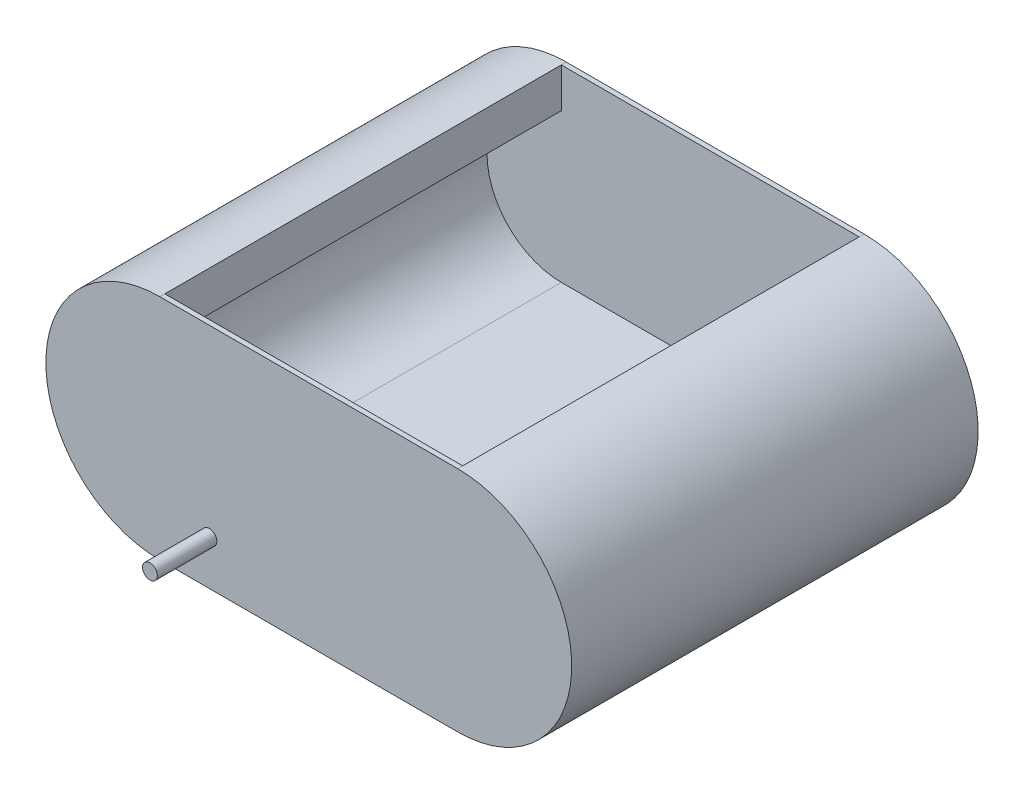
from build123d import *

# Parameters (mm, degrees)
SALIENTE_EXTRUIR2_DEPTH = 800
CROQUIS3_W              = 600.904889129
CROQUIS3_H              = 80
SALIENTE_EXTRUIR3_DEPTH = 10
SALIENTE_EXTRUIR4_START = 10
CROQUIS4_W              = 600.904889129
CROQUIS4_H              = 80
SALIENTE_EXTRUIR4_DEPTH = 10
CROQUIS5_R              = 15
SALIENTE_EXTRUIR5_DEPTH = 120
SALIENTE_EXTRUIR6_START = 120
CROQUIS6_R              = 15
SALIENTE_EXTRUIR6_DEPTH = 120


with BuildPart() as part:
    # Croquis2 → Saliente-Extruir2 (new body)
    with BuildSketch(Plane.XY):
        with BuildLine():
            Line((0, -230), (600.904889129, -230))
            ThreePointArc((600.904889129, -230), (830.904889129, 0), (600.904889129, 230))
            Line((600.904889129, 230), (600.904889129, 150))
            ThreePointArc((600.904889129, 150), (750.904889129, 0), (600.904889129, -150))
            Line((600.904889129, -150), (0, -150))
            ThreePointArc((0, -150), (-150, 0), (0, 150))
            Line((0, 150), (0, 230))
            ThreePointArc((0, 230), (-230, 0), (0, -230))
        make_face()
    extrude(amount=SALIENTE_EXTRUIR2_DEPTH)

    # Croquis3 → Saliente-Extruir3 (add)
    with BuildSketch(Plane.XY.offset(800)):
        with Locations((300.452444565, 190)):
            Rectangle(CROQUIS3_W, CROQUIS3_H)
        with BuildLine():
            Line((0, 150), (0, 230))
            ThreePointArc((0, 230), (-230, 0), (0, -230))
            Line((0, -230), (600.904889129, -230))
            ThreePointArc((600.904889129, -230), (830.904889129, 0), (600.904889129, 230))
            Line((600.904889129, 230), (600.904889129, 150))
            ThreePointArc((600.904889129, 150), (750.904889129, 0), (600.904889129, -150))
            Line((600.904889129, -150), (0, -150))
            ThreePointArc((0, -150), (-150, 0), (0, 150))
        make_face()
        with BuildLine():
            Line((0, 150), (600.904889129, 150))
            ThreePointArc((600.904889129, 150), (750.904889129, 0), (600.904889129, -150))
            Line((600.904889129, -150), (0, -150))
            ThreePointArc((0, -150), (-150, 0), (0, 150))
        make_face()
    extrude(amount=SALIENTE_EXTRUIR3_DEPTH)

    # Croquis4 → Saliente-Extruir4 (add)
    with BuildSketch(Plane(origin=(0, 0, 0), x_dir=(-1, 0, 0), z_dir=(0, 0, -1)).offset(SALIENTE_EXTRUIR4_START)):
        with BuildLine():
            Line((-600.904889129, 150), (0, 150))
            ThreePointArc((0, 150), (150, 0), (0, -150))
            Line((0, -150), (-600.904889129, -150))
            ThreePointArc((-600.904889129, -150), (-750.904889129, 0), (-600.904889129, 150))
        make_face()
        with Locations((-300.452444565, 190)):
            Rectangle(CROQUIS4_W, CROQUIS4_H)
        with BuildLine():
            Line((-600.904889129, -230), (0, -230))
            ThreePointArc((0, -230), (230, 0), (0, 230))
            Line((0, 230), (0, 150))
            ThreePointArc((0, 150), (150, 0), (0, -150))
            Line((0, -150), (-600.904889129, -150))
            ThreePointArc((-600.904889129, -150), (-750.904889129, 0), (-600.904889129, 150))
            Line((-600.904889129, 150), (-600.904889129, 230))
            ThreePointArc((-600.904889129, 230), (-830.904889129, 0), (-600.904889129, -230))
        make_face()
    extrude(amount=-SALIENTE_EXTRUIR4_DEPTH)

    # Croquis5 → Saliente-Extruir5 (add)
    with BuildSketch(Plane.XY.offset(810)):
        with Locations((100, -140)):
            Circle(CROQUIS5_R)
    extrude(amount=SALIENTE_EXTRUIR5_DEPTH)

    # Croquis6 → Saliente-Extruir6 (add)
    with BuildSketch(Plane(origin=(0, 0, -10), x_dir=(-1, 0, 0), z_dir=(0, 0, -1)).offset(SALIENTE_EXTRUIR6_START)):
        with Locations(Location((-100, -140, 0), (0, 0, 180))):
            Circle(CROQUIS6_R)
    extrude(amount=-SALIENTE_EXTRUIR6_DEPTH)


solid = part.part
